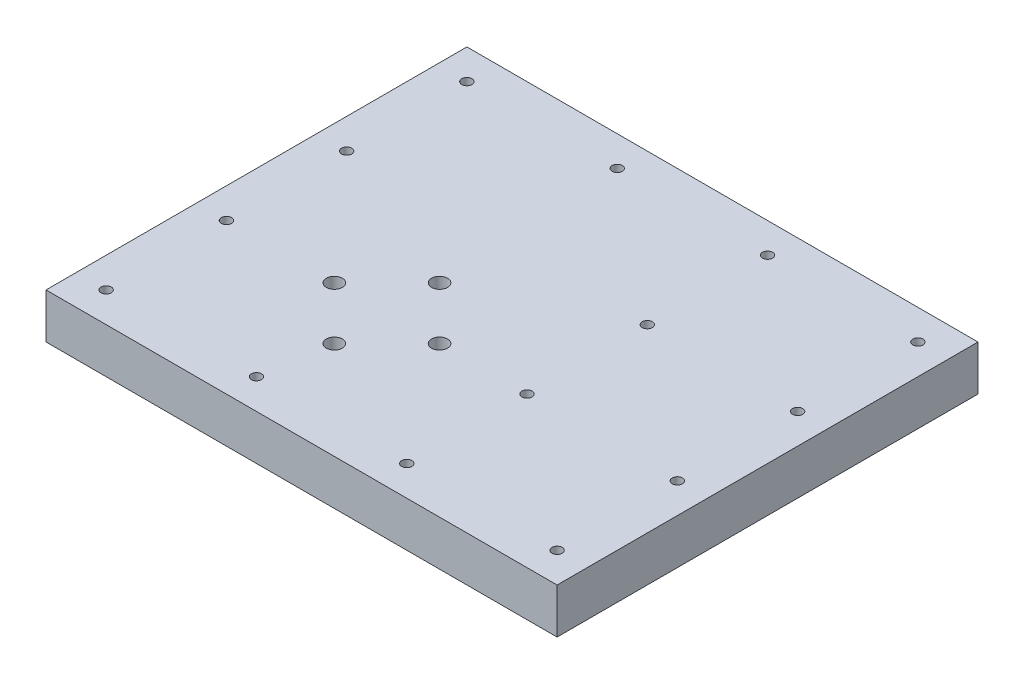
from build123d import *

# Parameters (mm, degrees)
SKETCH1_W                                           = 215.9
SKETCH1_H                                           = 177.8
BOSS_EXTRUDE1_DEPTH                                 = 19.05
CUT_EXTRUDE1_DEPTH                                  = 142.135803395
CUT_EXTRUDE1_DEPTH_BACK                             = 142.135803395
SKETCH2_R                                           = 3.3782
CBORE_FOR_8_BINDING_HEAD_MACHINE_SCREW1_D           = 4.3053
CBORE_FOR_8_BINDING_HEAD_MACHINE_SCREW1_CBORE_D     = 7.9375
CBORE_FOR_8_BINDING_HEAD_MACHINE_SCREW1_CBORE_DEPTH = 4.4196


with BuildPart() as part:
    # Sketch1 → Boss-Extrude1 (new body)
    with BuildSketch(Plane(origin=(0, 0, 0), x_dir=(1, 0, 0), z_dir=(0, 1, 0))):
        Rectangle(SKETCH1_W, SKETCH1_H)
    extrude(amount=BOSS_EXTRUDE1_DEPTH)

    # Sketch2 → Cut-Extrude1 (cut, two sides: drawn at the far end of the back side and taken through both)
    with BuildSketch(Plane(origin=(0, 19.05, 0), x_dir=(1, 0, 0), z_dir=(0, 1, 0)).offset(-CUT_EXTRUDE1_DEPTH_BACK)):
        with Locations(Location((-27.432, -3.175, 0), (0, 0, 270))):
            Circle(SKETCH2_R)
        with Locations(Location((-49.657, -25.4, 0), (0, 0, 270))):
            Circle(SKETCH2_R)
        with Locations(Location((-27.432, -47.625, 0), (0, 0, 270))):
            Circle(SKETCH2_R)
        with Locations(Location((-5.207, -25.4, 0), (0, 0, 270))):
            Circle(SKETCH2_R)
    extrude(amount=CUT_EXTRUDE1_DEPTH + CUT_EXTRUDE1_DEPTH_BACK, mode=Mode.SUBTRACT)

    # CBORE for _8 Binding Head Machine Screw1 (through all)
    with Locations(Plane(origin=(0, 0, 0), x_dir=(-1, 0, 0), z_dir=(0, -1, 0))):
        with Locations((-95.25, 76.2), (-95.25, 25.4), (-31.75, 25.4), (-31.75, 76.2), (31.75, 76.2), (95.25, 76.2), (95.25, 25.4), (95.25, -25.4), (-31.75, -25.4), (-95.25, -25.4), (-95.25, -76.2), (-31.75, -76.2), (31.75, -76.2), (95.25, -76.2)):
            CounterBoreHole(CBORE_FOR_8_BINDING_HEAD_MACHINE_SCREW1_D / 2, CBORE_FOR_8_BINDING_HEAD_MACHINE_SCREW1_CBORE_D / 2, CBORE_FOR_8_BINDING_HEAD_MACHINE_SCREW1_CBORE_DEPTH)


solid = part.part
